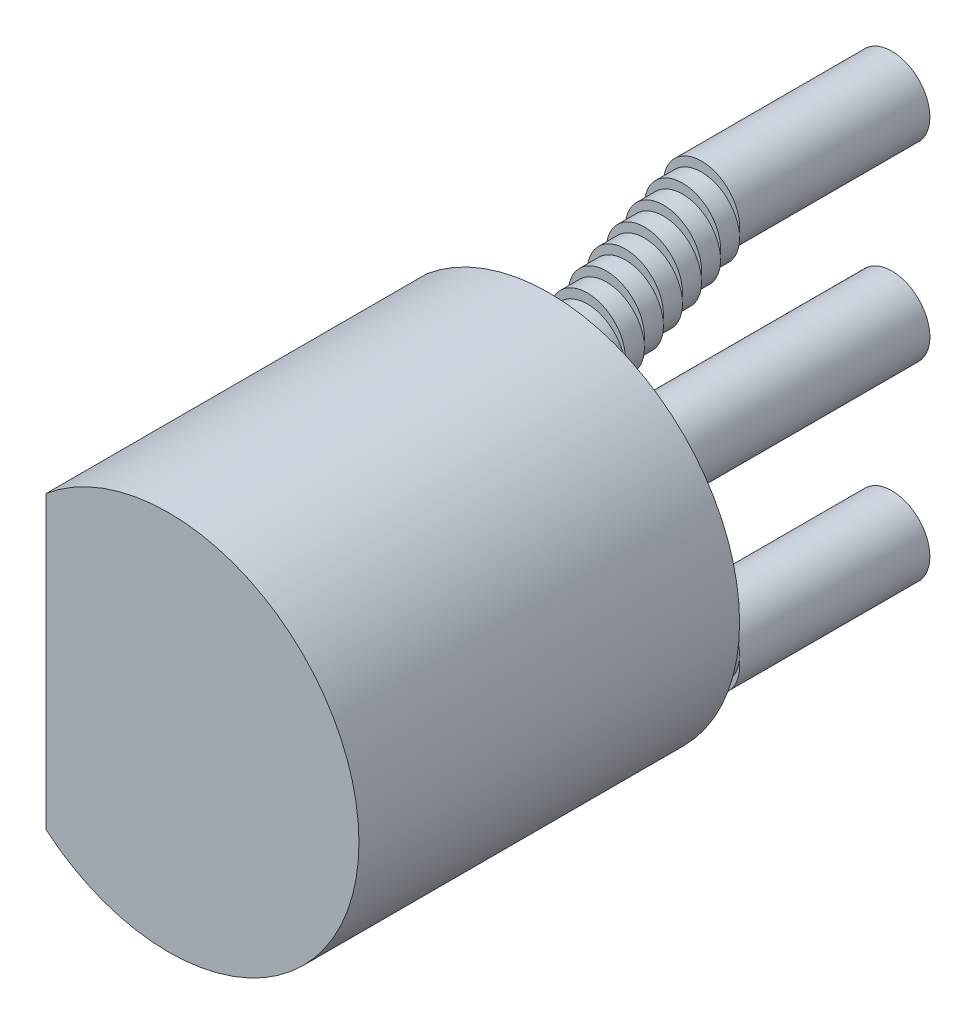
from build123d import *

# Parameters (mm, degrees)
BOSS_EXTRUDE1_DEPTH  = 5.08
SKETCH2_R            = 0.508
BOSS_EXTRUDE2_DEPTH  = 4.572
SKETCH3_R            = 0.508
BOSS_EXTRUDE3_DEPTH  = 0.254
SKETCH4_R            = 0.508
BOSS_EXTRUDE4_DEPTH  = 0.254
SKETCH5_R            = 0.508
BOSS_EXTRUDE5_DEPTH  = 0.254
SKETCH6_R            = 0.508
BOSS_EXTRUDE6_DEPTH  = 0.254
SKETCH7_R            = 0.508
BOSS_EXTRUDE7_DEPTH  = 0.254
SKETCH8_R            = 0.508
BOSS_EXTRUDE8_DEPTH  = 0.254
SKETCH9_R            = 0.508
BOSS_EXTRUDE9_DEPTH  = 0.254
SKETCH10_R           = 0.508
BOSS_EXTRUDE10_DEPTH = 0.254
SKETCH11_R           = 0.508
BOSS_EXTRUDE11_DEPTH = 2.54


with BuildPart() as part:
    # Sketch1 → Boss-Extrude1 (new body)
    with BuildSketch(Plane.XY):
        with BuildLine():
            Line((-1.635449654, 1.943425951), (-1.635449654, -1.943425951))
            ThreePointArc((-1.635449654, -1.943425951), (2.54, 0), (-1.635449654, 1.943425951))
        make_face()
    extrude(amount=BOSS_EXTRUDE1_DEPTH)

    # Sketch2 → Boss-Extrude2 (add)
    with BuildSketch(Plane(origin=(0, 0, 0), x_dir=(-1, 0, 0), z_dir=(0, 0, -1))):
        Circle(SKETCH2_R)
    extrude(amount=BOSS_EXTRUDE2_DEPTH)

    # Sketch3 → Boss-Extrude3 (add)
    with BuildSketch(Plane(origin=(0, 0, 0), x_dir=(-1, 0, 0), z_dir=(0, 0, -1))):
        with Locations((0, 1.524)):
            Circle(SKETCH3_R)
        with Locations((0, -1.524)):
            Circle(SKETCH3_R)
    extrude(amount=BOSS_EXTRUDE3_DEPTH)

    # Sketch4 → Boss-Extrude4 (add)
    with BuildSketch(Plane(origin=(0, 0, -0.254), x_dir=(-1, 0, 0), z_dir=(0, 0, -1))):
        with Locations(Location((0, 1.651, 0), (0, 0, 187.180755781))):
            Circle(SKETCH4_R)
        with Locations(Location((0, -1.651, 0), (0, 0, 172.819244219))):
            Circle(SKETCH4_R)
    extrude(amount=BOSS_EXTRUDE4_DEPTH)

    # Sketch5 → Boss-Extrude5 (add)
    with BuildSketch(Plane(origin=(0, 0, -0.508), x_dir=(-1, 0, 0), z_dir=(0, 0, -1))):
        with Locations(Location((0, 1.778, 0), (0, 0, 187.180755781))):
            Circle(SKETCH5_R)
        with Locations(Location((0, -1.778, 0), (0, 0, 172.819244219))):
            Circle(SKETCH5_R)
    extrude(amount=BOSS_EXTRUDE5_DEPTH)

    # Sketch6 → Boss-Extrude6 (add)
    with BuildSketch(Plane(origin=(0, 0, -0.762), x_dir=(-1, 0, 0), z_dir=(0, 0, -1))):
        with Locations(Location((0, 1.905, 0), (0, 0, 187.180755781))):
            Circle(SKETCH6_R)
        with Locations(Location((0, -1.905, 0), (0, 0, 172.819244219))):
            Circle(SKETCH6_R)
    extrude(amount=BOSS_EXTRUDE6_DEPTH)

    # Sketch7 → Boss-Extrude7 (add)
    with BuildSketch(Plane(origin=(0, 0, -1.016), x_dir=(-1, 0, 0), z_dir=(0, 0, -1))):
        with Locations(Location((0, 2.032, 0), (0, 0, 187.180755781))):
            Circle(SKETCH7_R)
        with Locations(Location((0, -2.032, 0), (0, 0, 172.819244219))):
            Circle(SKETCH7_R)
    extrude(amount=BOSS_EXTRUDE7_DEPTH)

    # Sketch8 → Boss-Extrude8 (add)
    with BuildSketch(Plane(origin=(0, 0, -1.27), x_dir=(-1, 0, 0), z_dir=(0, 0, -1))):
        with Locations(Location((0, 2.159, 0), (0, 0, 187.180755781))):
            Circle(SKETCH8_R)
        with Locations(Location((0, -2.159, 0), (0, 0, 172.819244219))):
            Circle(SKETCH8_R)
    extrude(amount=BOSS_EXTRUDE8_DEPTH)

    # Sketch9 → Boss-Extrude9 (add)
    with BuildSketch(Plane(origin=(0, 0, -1.524), x_dir=(-1, 0, 0), z_dir=(0, 0, -1))):
        with Locations(Location((0, 2.286, 0), (0, 0, 187.180755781))):
            Circle(SKETCH9_R)
        with Locations(Location((0, -2.286, 0), (0, 0, 172.819244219))):
            Circle(SKETCH9_R)
    extrude(amount=BOSS_EXTRUDE9_DEPTH)

    # Sketch10 → Boss-Extrude10 (add)
    with BuildSketch(Plane(origin=(0, 0, -1.778), x_dir=(-1, 0, 0), z_dir=(0, 0, -1))):
        with Locations(Location((0, 2.413, 0), (0, 0, 187.180755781))):
            Circle(SKETCH10_R)
        with Locations(Location((0, -2.413, 0), (0, 0, 172.819244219))):
            Circle(SKETCH10_R)
    extrude(amount=BOSS_EXTRUDE10_DEPTH)

    # Sketch11 → Boss-Extrude11 (add)
    with BuildSketch(Plane(origin=(0, 0, -2.032), x_dir=(-1, 0, 0), z_dir=(0, 0, -1))):
        with Locations(Location((0, 2.54, 0), (0, 0, 187.180755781))):
            Circle(SKETCH11_R)
        with Locations(Location((0, -2.54, 0), (0, 0, 172.819244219))):
            Circle(SKETCH11_R)
    extrude(amount=BOSS_EXTRUDE11_DEPTH)


solid = part.part
